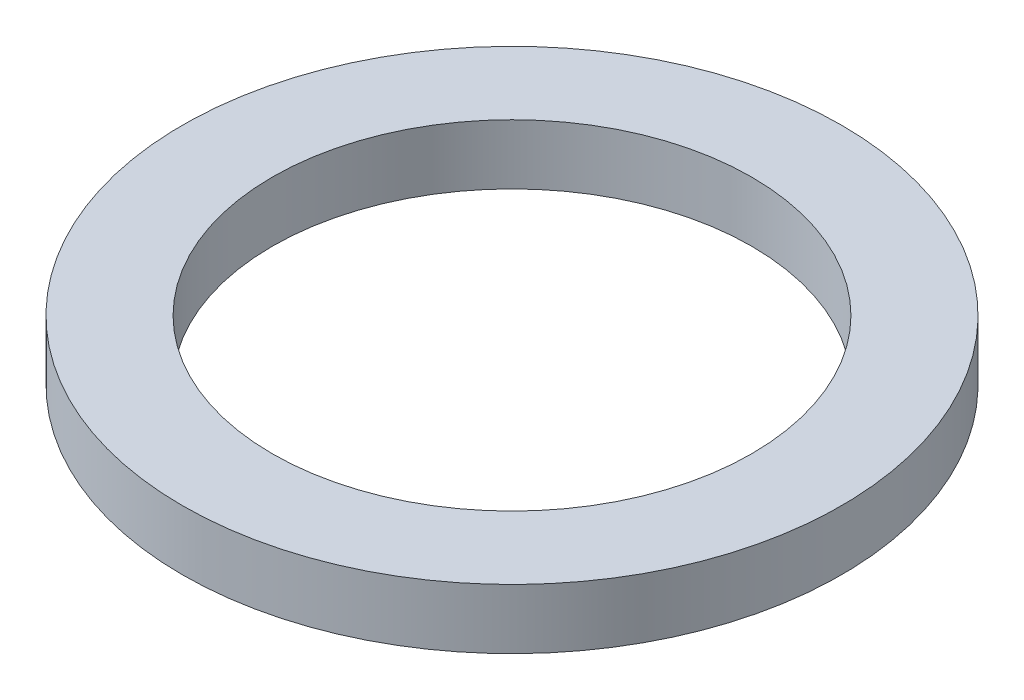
from build123d import *

# Parameters (mm, degrees)
SKETCH1_R           = 5.5
SKETCH1_R_2         = 4
BOSS_EXTRUDE1_DEPTH = 0.5


with BuildPart() as part:
    # Sketch1 → Boss-Extrude1 (new, symmetric)
    with BuildSketch(Plane(origin=(0, 0, 0), x_dir=(1, 0, 0), z_dir=(0, 1, 0))):
        with Locations(Location((0, 0, 0), (0, 0, 270))):
            Circle(SKETCH1_R)
        with Locations(Location((0, 0, 0), (0, 0, 270))):
            Circle(SKETCH1_R_2, mode=Mode.SUBTRACT)
    extrude(amount=BOSS_EXTRUDE1_DEPTH, both=True)


solid = part.part
